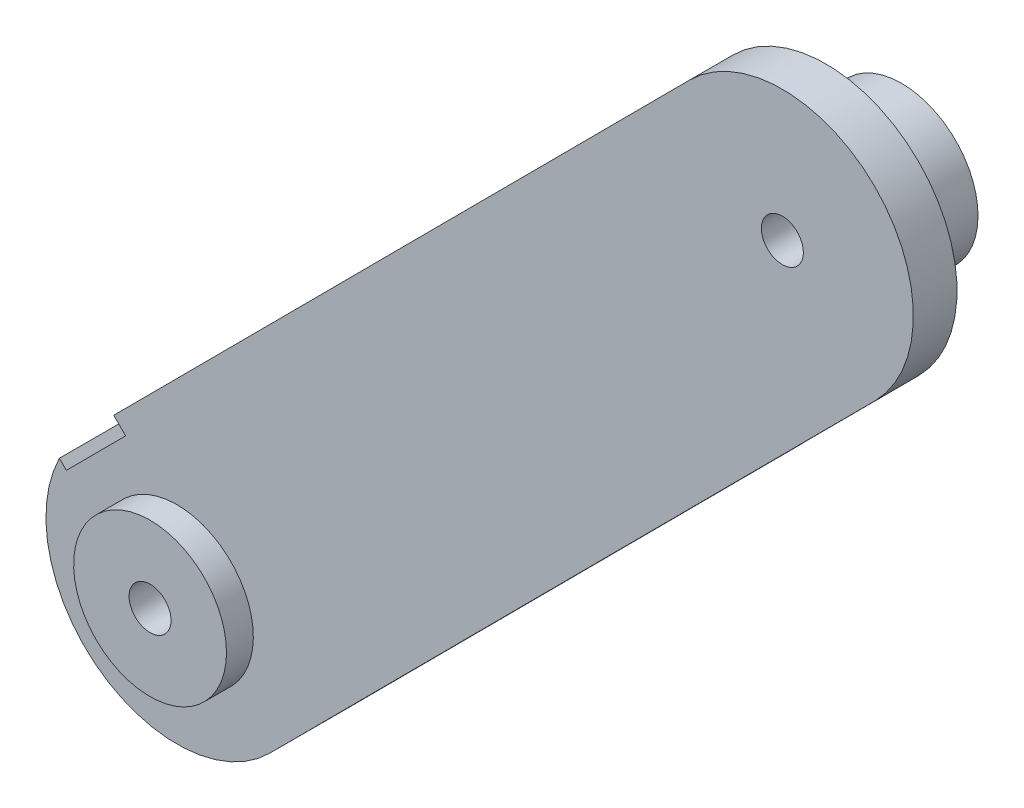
ISO-10303-21;
HEADER;
FILE_DESCRIPTION(('STEP AP214'),'2;1');
FILE_NAME('part.step','',(''),(''),'','','');
FILE_SCHEMA(('AUTOMOTIVE_DESIGN { 1 0 10303 214 1 1 1 1 }'));
ENDSEC;
DATA;
#1=APPLICATION_CONTEXT('core data for automotive mechanical design processes');
#2=APPLICATION_PROTOCOL_DEFINITION('international standard','automotive_design',2000,#1);
#3=PRODUCT_CONTEXT('',#1,'mechanical');
#4=PRODUCT('Part','Part','',(#3));
#5=PRODUCT_RELATED_PRODUCT_CATEGORY('part','',(#4));
#6=PRODUCT_DEFINITION_FORMATION('','',#4);
#7=PRODUCT_DEFINITION_CONTEXT('part definition',#1,'design');
#8=PRODUCT_DEFINITION('design','',#6,#7);
#9=PRODUCT_DEFINITION_SHAPE('','',#8);
#10=(LENGTH_UNIT() NAMED_UNIT(*) SI_UNIT(.MILLI.,.METRE.));
#11=(NAMED_UNIT(*) PLANE_ANGLE_UNIT() SI_UNIT($,.RADIAN.));
#12=(NAMED_UNIT(*) SI_UNIT($,.STERADIAN.) SOLID_ANGLE_UNIT());
#13=UNCERTAINTY_MEASURE_WITH_UNIT(LENGTH_MEASURE(1.E-05),#10,'distance_accuracy_value','');
#14=(GEOMETRIC_REPRESENTATION_CONTEXT(3) GLOBAL_UNCERTAINTY_ASSIGNED_CONTEXT((#13)) GLOBAL_UNIT_ASSIGNED_CONTEXT((#10,
#11,#12)) REPRESENTATION_CONTEXT('',''));
#15=CARTESIAN_POINT('',(0.,0.,0.));
#16=DIRECTION('',(0.,0.,1.));
#17=DIRECTION('',(1.,0.,0.));
#18=AXIS2_PLACEMENT_3D('',#15,#16,#17);
#19=CARTESIAN_POINT('',(88.4066610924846,19.98499077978,4.4196));
#20=DIRECTION('',(0.,0.,1.));
#21=DIRECTION('',(0.708586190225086,-0.705624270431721,0.));
#22=AXIS2_PLACEMENT_3D('',#19,#20,#21);
#23=PLANE('',#22);
#24=CARTESIAN_POINT('',(91.8389073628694,19.9921791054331,4.4196));
#25=DIRECTION('',(0.,0.,-1.));
#26=DIRECTION('',(-1.,0.,0.));
#27=AXIS2_PLACEMENT_3D('',#24,#25,#26);
#28=CIRCLE('',#27,0.634999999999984);
#29=CARTESIAN_POINT('',(91.3908359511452,19.5422268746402,4.4196));
#30=VERTEX_POINT('',#29);
#31=EDGE_CURVE('E10',#30,#30,#28,.T.);
#32=ORIENTED_EDGE('',*,*,#31,.T.);
#33=EDGE_LOOP('',(#32));
#34=FACE_BOUND('',#33,.T.);
#35=CARTESIAN_POINT('',(91.8389073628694,19.9921791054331,4.41960000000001));
#36=DIRECTION('',(0.,0.,-1.));
#37=DIRECTION('',(-1.,0.,0.));
#38=AXIS2_PLACEMENT_3D('',#35,#36,#37);
#39=CIRCLE('',#38,2.3114);
#40=CARTESIAN_POINT('',(90.2079274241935,18.3543529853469,4.4196));
#41=VERTEX_POINT('',#40);
#42=EDGE_CURVE('E25',#41,#41,#39,.T.);
#43=ORIENTED_EDGE('',*,*,#42,.F.);
#44=EDGE_LOOP('',(#43));
#45=FACE_BOUND('',#44,.T.);
#46=ADVANCED_FACE('F15',(#34,#45),#23,.T.);
#47=CARTESIAN_POINT('',(91.8389073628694,19.9921791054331,0.));
#48=DIRECTION('',(0.,0.,1.));
#49=DIRECTION('',(1.,0.,0.));
#50=AXIS2_PLACEMENT_3D('',#47,#48,#49);
#51=CYLINDRICAL_SURFACE('',#50,2.3114);
#52=CARTESIAN_POINT('',(91.8389073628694,19.9921791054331,3.6068));
#53=DIRECTION('',(0.,0.,-1.));
#54=DIRECTION('',(-1.,0.,0.));
#55=AXIS2_PLACEMENT_3D('',#52,#53,#54);
#56=CIRCLE('',#55,2.31140000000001);
#57=CARTESIAN_POINT('',(90.2079274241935,18.3543529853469,3.6068));
#58=VERTEX_POINT('',#57);
#59=EDGE_CURVE('E223',#58,#58,#56,.T.);
#60=ORIENTED_EDGE('',*,*,#59,.F.);
#61=DIRECTION('',(0.,0.,-1.));
#62=VECTOR('',#61,1.);
#63=CARTESIAN_POINT('',(90.2079274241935,18.3543529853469,4.0132));
#64=LINE('',#63,#62);
#65=EDGE_CURVE('E216',#41,#58,#64,.T.);
#66=ORIENTED_EDGE('',*,*,#65,.F.);
#67=ORIENTED_EDGE('',*,*,#42,.T.);
#68=ORIENTED_EDGE('',*,*,#65,.T.);
#69=EDGE_LOOP('',(#60,#66,#67,#68));
#70=FACE_BOUND('',#69,.T.);
#71=ADVANCED_FACE('F210',(#70),#51,.T.);
#72=CARTESIAN_POINT('',(110.597995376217,44.7262353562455,3.6068));
#73=DIRECTION('',(0.,0.,1.));
#74=DIRECTION('',(-0.705624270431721,-0.708586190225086,0.));
#75=AXIS2_PLACEMENT_3D('',#72,#73,#74);
#76=PLANE('',#75);
#77=CARTESIAN_POINT('',(110.152482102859,38.3826266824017,3.6068));
#78=DIRECTION('',(0.,0.,-1.));
#79=DIRECTION('',(-1.,0.,0.));
#80=AXIS2_PLACEMENT_3D('',#77,#78,#79);
#81=CIRCLE('',#80,0.634999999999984);
#82=CARTESIAN_POINT('',(109.704410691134,37.9326744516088,3.6068));
#83=VERTEX_POINT('',#82);
#84=EDGE_CURVE('E218',#83,#83,#81,.T.);
#85=ORIENTED_EDGE('',*,*,#84,.T.);
#86=EDGE_LOOP('',(#85));
#87=FACE_BOUND('',#86,.T.);
#88=ORIENTED_EDGE('',*,*,#59,.T.);
#89=EDGE_LOOP('',(#88));
#90=FACE_BOUND('',#89,.T.);
#91=DIRECTION('',(0.708586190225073,-0.705624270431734,0.));
#92=VECTOR('',#91,1.);
#93=CARTESIAN_POINT('',(90.1073291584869,23.508820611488,3.6068));
#94=LINE('',#93,#92);
#95=CARTESIAN_POINT('',(89.9273482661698,23.6880491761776,3.6068));
#96=VERTEX_POINT('',#95);
#97=CARTESIAN_POINT('',(90.2873100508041,23.3295920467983,3.6068));
#98=VERTEX_POINT('',#97);
#99=EDGE_CURVE('E226',#96,#98,#94,.T.);
#100=ORIENTED_EDGE('',*,*,#99,.T.);
#101=DIRECTION('',(-0.70562427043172,-0.708586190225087,0.));
#102=VECTOR('',#101,1.);
#103=CARTESIAN_POINT('',(89.3911672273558,22.4296875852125,3.6068));
#104=LINE('',#103,#102);
#105=CARTESIAN_POINT('',(88.4950244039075,21.5297831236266,3.6068));
#106=VERTEX_POINT('',#105);
#107=EDGE_CURVE('E229',#98,#106,#104,.T.);
#108=ORIENTED_EDGE('',*,*,#107,.T.);
#109=DIRECTION('',(-0.708586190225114,0.705624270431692,0.));
#110=VECTOR('',#109,1.);
#111=CARTESIAN_POINT('',(88.3891048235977,21.6352599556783,3.6068));
#112=LINE('',#111,#110);
#113=CARTESIAN_POINT('',(88.2831852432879,21.74073678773,3.6068));
#114=VERTEX_POINT('',#113);
#115=EDGE_CURVE('E232',#106,#114,#112,.T.);
#116=ORIENTED_EDGE('',*,*,#115,.T.);
#117=CARTESIAN_POINT('',(91.8389073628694,19.9921791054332,3.6068));
#118=DIRECTION('',(0.,0.,1.));
#119=DIRECTION('',(1.,0.,0.));
#120=AXIS2_PLACEMENT_3D('',#117,#118,#119);
#121=CIRCLE('',#120,3.96240000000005);
#122=CARTESIAN_POINT('',(94.6466092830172,17.1962134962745,3.6068));
#123=VERTEX_POINT('',#122);
#124=EDGE_CURVE('E235',#114,#123,#121,.T.);
#125=ORIENTED_EDGE('',*,*,#124,.T.);
#126=DIRECTION('',(-0.705624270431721,-0.708586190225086,0.));
#127=VECTOR('',#126,1.);
#128=CARTESIAN_POINT('',(103.803396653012,26.3914372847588,3.6068));
#129=LINE('',#128,#127);
#130=CARTESIAN_POINT('',(112.960184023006,35.5866610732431,3.6068));
#131=VERTEX_POINT('',#130);
#132=EDGE_CURVE('E276',#131,#123,#129,.T.);
#133=ORIENTED_EDGE('',*,*,#132,.F.);
#134=CARTESIAN_POINT('',(110.152482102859,38.3826266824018,3.6068));
#135=DIRECTION('',(0.,0.,1.));
#136=DIRECTION('',(1.,0.,0.));
#137=AXIS2_PLACEMENT_3D('',#134,#135,#136);
#138=CIRCLE('',#137,3.96239999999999);
#139=CARTESIAN_POINT('',(107.344780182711,41.1785922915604,3.6068));
#140=VERTEX_POINT('',#139);
#141=EDGE_CURVE('E238',#131,#140,#138,.T.);
#142=ORIENTED_EDGE('',*,*,#141,.T.);
#143=DIRECTION('',(-0.705624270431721,-0.708586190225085,0.));
#144=VECTOR('',#143,1.);
#145=CARTESIAN_POINT('',(98.6360642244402,32.433320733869,3.6068));
#146=LINE('',#145,#144);
#147=EDGE_CURVE('E241',#140,#96,#146,.T.);
#148=ORIENTED_EDGE('',*,*,#147,.T.);
#149=EDGE_LOOP('',(#100,#108,#116,#125,#133,#142,#148));
#150=FACE_BOUND('',#149,.T.);
#151=ADVANCED_FACE('F305',(#87,#90,#150),#76,.T.);
#152=CARTESIAN_POINT('',(90.2873100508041,23.3295920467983,1.3208));
#153=DIRECTION('',(-0.705624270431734,-0.708586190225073,0.));
#154=DIRECTION('',(0.,0.,1.));
#155=AXIS2_PLACEMENT_3D('',#152,#153,#154);
#156=PLANE('',#155);
#157=ORIENTED_EDGE('',*,*,#99,.F.);
#158=DIRECTION('',(0.,0.,1.));
#159=VECTOR('',#158,1.);
#160=CARTESIAN_POINT('',(89.9273482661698,23.6880491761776,2.4638));
#161=LINE('',#160,#159);
#162=CARTESIAN_POINT('',(89.9273482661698,23.6880491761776,1.3208));
#163=VERTEX_POINT('',#162);
#164=EDGE_CURVE('E247',#163,#96,#161,.T.);
#165=ORIENTED_EDGE('',*,*,#164,.F.);
#166=DIRECTION('',(-0.708586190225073,0.705624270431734,0.));
#167=VECTOR('',#166,1.);
#168=CARTESIAN_POINT('',(90.1073291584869,23.508820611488,1.3208));
#169=LINE('',#168,#167);
#170=CARTESIAN_POINT('',(90.2873100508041,23.3295920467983,1.3208));
#171=VERTEX_POINT('',#170);
#172=EDGE_CURVE('E145',#171,#163,#169,.T.);
#173=ORIENTED_EDGE('',*,*,#172,.F.);
#174=DIRECTION('',(0.,0.,1.));
#175=VECTOR('',#174,1.);
#176=CARTESIAN_POINT('',(90.2873100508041,23.3295920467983,2.4638));
#177=LINE('',#176,#175);
#178=EDGE_CURVE('E244',#171,#98,#177,.T.);
#179=ORIENTED_EDGE('',*,*,#178,.T.);
#180=EDGE_LOOP('',(#157,#165,#173,#179));
#181=FACE_BOUND('',#180,.T.);
#182=ADVANCED_FACE('F311',(#181),#156,.T.);
#183=CARTESIAN_POINT('',(89.0312054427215,22.7881447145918,3.6068));
#184=DIRECTION('',(-0.708586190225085,0.705624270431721,0.));
#185=DIRECTION('',(0.705624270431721,0.708586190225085,0.));
#186=AXIS2_PLACEMENT_3D('',#183,#184,#185);
#187=PLANE('',#186);
#188=ORIENTED_EDGE('',*,*,#164,.T.);
#189=ORIENTED_EDGE('',*,*,#147,.F.);
#190=DIRECTION('',(0.,0.,1.));
#191=VECTOR('',#190,1.);
#192=CARTESIAN_POINT('',(107.344780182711,41.1785922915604,2.9464));
#193=LINE('',#192,#191);
#194=CARTESIAN_POINT('',(107.344780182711,41.1785922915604,2.286));
#195=VERTEX_POINT('',#194);
#196=EDGE_CURVE('E260',#195,#140,#193,.T.);
#197=ORIENTED_EDGE('',*,*,#196,.F.);
#198=DIRECTION('',(-0.705624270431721,-0.708586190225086,0.));
#199=VECTOR('',#198,1.);
#200=CARTESIAN_POINT('',(105.373265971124,39.1988024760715,2.286));
#201=LINE('',#200,#199);
#202=CARTESIAN_POINT('',(103.401751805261,37.2190126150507,2.286));
#203=VERTEX_POINT('',#202);
#204=EDGE_CURVE('E249',#195,#203,#201,.T.);
#205=ORIENTED_EDGE('',*,*,#204,.T.);
#206=CARTESIAN_POINT('',(103.401751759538,37.2190126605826,1.52400000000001));
#207=DIRECTION('',(0.708586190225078,-0.705624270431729,0.));
#208=DIRECTION('',(0.705624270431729,0.708586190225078,0.));
#209=AXIS2_PLACEMENT_3D('',#206,#207,#208);
#210=CIRCLE('',#209,0.761999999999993);
#211=CARTESIAN_POINT('',(102.864066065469,36.6790699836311,1.524));
#212=VERTEX_POINT('',#211);
#213=EDGE_CURVE('E252',#203,#212,#210,.T.);
#214=ORIENTED_EDGE('',*,*,#213,.T.);
#215=DIRECTION('',(0.,0.,-1.));
#216=VECTOR('',#215,1.);
#217=CARTESIAN_POINT('',(102.864066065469,36.6790699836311,1.4224));
#218=LINE('',#217,#216);
#219=CARTESIAN_POINT('',(102.864066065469,36.6790699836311,1.3208));
#220=VERTEX_POINT('',#219);
#221=EDGE_CURVE('E255',#212,#220,#218,.T.);
#222=ORIENTED_EDGE('',*,*,#221,.T.);
#223=DIRECTION('',(0.705624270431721,0.708586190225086,0.));
#224=VECTOR('',#223,1.);
#225=CARTESIAN_POINT('',(96.3957071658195,30.1835595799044,1.3208));
#226=LINE('',#225,#224);
#227=EDGE_CURVE('E149',#163,#220,#226,.T.);
#228=ORIENTED_EDGE('',*,*,#227,.F.);
#229=EDGE_LOOP('',(#188,#189,#197,#205,#214,#222,#228));
#230=FACE_BOUND('',#229,.T.);
#231=ADVANCED_FACE('F315',(#230),#187,.T.);
#232=CARTESIAN_POINT('',(110.152482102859,38.3826266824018,3.6068));
#233=DIRECTION('',(0.,0.,-1.));
#234=DIRECTION('',(0.,1.,0.));
#235=AXIS2_PLACEMENT_3D('',#232,#233,#234);
#236=CYLINDRICAL_SURFACE('',#235,3.96239999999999);
#237=CARTESIAN_POINT('',(110.152482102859,38.3826266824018,2.286));
#238=DIRECTION('',(0.,0.,1.));
#239=DIRECTION('',(1.,0.,0.));
#240=AXIS2_PLACEMENT_3D('',#237,#238,#239);
#241=CIRCLE('',#240,3.96239999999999);
#242=CARTESIAN_POINT('',(112.960184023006,35.5866610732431,2.286));
#243=VERTEX_POINT('',#242);
#244=EDGE_CURVE('E258',#243,#195,#241,.T.);
#245=ORIENTED_EDGE('',*,*,#244,.T.);
#246=ORIENTED_EDGE('',*,*,#196,.T.);
#247=ORIENTED_EDGE('',*,*,#141,.F.);
#248=DIRECTION('',(0.,0.,1.));
#249=VECTOR('',#248,1.);
#250=CARTESIAN_POINT('',(112.960184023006,35.5866610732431,2.9464));
#251=LINE('',#250,#249);
#252=EDGE_CURVE('E274',#243,#131,#251,.T.);
#253=ORIENTED_EDGE('',*,*,#252,.F.);
#254=EDGE_LOOP('',(#245,#246,#247,#253));
#255=FACE_BOUND('',#254,.T.);
#256=ADVANCED_FACE('F329',(#255),#236,.T.);
#257=CARTESIAN_POINT('',(116.07845174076,38.4372457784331,2.286));
#258=DIRECTION('',(0.,0.,-1.));
#259=DIRECTION('',(-0.70562427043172,-0.708586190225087,0.));
#260=AXIS2_PLACEMENT_3D('',#257,#258,#259);
#261=PLANE('',#260);
#262=CARTESIAN_POINT('',(110.152482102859,38.3826266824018,2.286));
#263=DIRECTION('',(0.,0.,-1.));
#264=DIRECTION('',(-1.,0.,0.));
#265=AXIS2_PLACEMENT_3D('',#262,#263,#264);
#266=CIRCLE('',#265,3.07340000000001);
#267=CARTESIAN_POINT('',(112.321147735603,40.5603954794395,2.286));
#268=VERTEX_POINT('',#267);
#269=EDGE_CURVE('E179',#268,#268,#266,.T.);
#270=ORIENTED_EDGE('',*,*,#269,.F.);
#271=EDGE_LOOP('',(#270));
#272=FACE_BOUND('',#271,.T.);
#273=DIRECTION('',(0.708586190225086,-0.70562427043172,0.));
#274=VECTOR('',#273,1.);
#275=CARTESIAN_POINT('',(106.209453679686,34.423047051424,2.286));
#276=LINE('',#275,#274);
#277=CARTESIAN_POINT('',(109.017155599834,31.6270814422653,2.286));
#278=VERTEX_POINT('',#277);
#279=EDGE_CURVE('E265',#203,#278,#276,.T.);
#280=ORIENTED_EDGE('',*,*,#279,.F.);
#281=ORIENTED_EDGE('',*,*,#204,.F.);
#282=ORIENTED_EDGE('',*,*,#244,.F.);
#283=DIRECTION('',(0.70562427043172,0.708586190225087,0.));
#284=VECTOR('',#283,1.);
#285=CARTESIAN_POINT('',(110.98866981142,33.6068712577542,2.286));
#286=LINE('',#285,#284);
#287=EDGE_CURVE('E271',#278,#243,#286,.T.);
#288=ORIENTED_EDGE('',*,*,#287,.F.);
#289=EDGE_LOOP('',(#280,#281,#282,#288));
#290=FACE_BOUND('',#289,.T.);
#291=ADVANCED_FACE('F325',(#272,#290),#261,.T.);
#292=CARTESIAN_POINT('',(103.401751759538,37.2190126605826,1.52400000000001));
#293=DIRECTION('',(0.708586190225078,-0.705624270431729,0.));
#294=DIRECTION('',(0.705624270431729,0.708586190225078,0.));
#295=AXIS2_PLACEMENT_3D('',#292,#293,#294);
#296=CYLINDRICAL_SURFACE('',#295,0.761999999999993);
#297=DIRECTION('',(-0.708586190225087,0.70562427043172,0.));
#298=VECTOR('',#297,1.);
#299=CARTESIAN_POINT('',(105.671767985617,33.8831043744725,1.524));
#300=LINE('',#299,#298);
#301=CARTESIAN_POINT('',(108.479469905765,31.0871387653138,1.524));
#302=VERTEX_POINT('',#301);
#303=EDGE_CURVE('E263',#302,#212,#300,.T.);
#304=ORIENTED_EDGE('',*,*,#303,.T.);
#305=ORIENTED_EDGE('',*,*,#213,.F.);
#306=ORIENTED_EDGE('',*,*,#279,.T.);
#307=CARTESIAN_POINT('',(109.017155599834,31.6270814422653,1.524));
#308=DIRECTION('',(-0.70858619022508,0.705624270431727,0.));
#309=DIRECTION('',(-0.705624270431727,-0.70858619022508,0.));
#310=AXIS2_PLACEMENT_3D('',#307,#308,#309);
#311=CIRCLE('',#310,0.761999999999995);
#312=EDGE_CURVE('E268',#302,#278,#311,.T.);
#313=ORIENTED_EDGE('',*,*,#312,.F.);
#314=EDGE_LOOP('',(#304,#305,#306,#313));
#315=FACE_BOUND('',#314,.T.);
#316=ADVANCED_FACE('F322',(#315),#296,.F.);
#317=CARTESIAN_POINT('',(102.864066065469,36.6790699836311,1.3208));
#318=DIRECTION('',(0.70562427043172,0.708586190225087,0.));
#319=DIRECTION('',(0.,0.,1.));
#320=AXIS2_PLACEMENT_3D('',#317,#318,#319);
#321=PLANE('',#320);
#322=ORIENTED_EDGE('',*,*,#303,.F.);
#323=DIRECTION('',(0.,0.,1.));
#324=VECTOR('',#323,1.);
#325=CARTESIAN_POINT('',(108.479469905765,31.0871387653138,1.4224));
#326=LINE('',#325,#324);
#327=CARTESIAN_POINT('',(108.479469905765,31.0871387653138,1.3208));
#328=VERTEX_POINT('',#327);
#329=EDGE_CURVE('E285',#328,#302,#326,.T.);
#330=ORIENTED_EDGE('',*,*,#329,.F.);
#331=DIRECTION('',(0.708586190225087,-0.70562427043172,0.));
#332=VECTOR('',#331,1.);
#333=CARTESIAN_POINT('',(105.671767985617,33.8831043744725,1.3208));
#334=LINE('',#333,#332);
#335=EDGE_CURVE('E155',#220,#328,#334,.T.);
#336=ORIENTED_EDGE('',*,*,#335,.F.);
#337=ORIENTED_EDGE('',*,*,#221,.F.);
#338=EDGE_LOOP('',(#322,#330,#336,#337));
#339=FACE_BOUND('',#338,.T.);
#340=ADVANCED_FACE('F319',(#339),#321,.T.);
#341=CARTESIAN_POINT('',(112.960184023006,35.5866610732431,3.6068));
#342=DIRECTION('',(0.708586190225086,-0.705624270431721,0.));
#343=DIRECTION('',(-0.705624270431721,-0.708586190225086,0.));
#344=AXIS2_PLACEMENT_3D('',#341,#342,#343);
#345=PLANE('',#344);
#346=ORIENTED_EDGE('',*,*,#312,.T.);
#347=ORIENTED_EDGE('',*,*,#287,.T.);
#348=ORIENTED_EDGE('',*,*,#252,.T.);
#349=ORIENTED_EDGE('',*,*,#132,.T.);
#350=DIRECTION('',(0.,0.,-1.));
#351=VECTOR('',#350,1.);
#352=CARTESIAN_POINT('',(94.6466092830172,17.1962134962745,2.4638));
#353=LINE('',#352,#351);
#354=CARTESIAN_POINT('',(94.6466092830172,17.1962134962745,1.3208));
#355=VERTEX_POINT('',#354);
#356=EDGE_CURVE('E279',#123,#355,#353,.T.);
#357=ORIENTED_EDGE('',*,*,#356,.T.);
#358=DIRECTION('',(0.705624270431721,0.708586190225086,0.));
#359=VECTOR('',#358,1.);
#360=CARTESIAN_POINT('',(101.563039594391,24.1416761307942,1.3208));
#361=LINE('',#360,#359);
#362=EDGE_CURVE('E282',#355,#328,#361,.T.);
#363=ORIENTED_EDGE('',*,*,#362,.T.);
#364=ORIENTED_EDGE('',*,*,#329,.T.);
#365=EDGE_LOOP('',(#346,#347,#348,#349,#357,#363,#364));
#366=FACE_BOUND('',#365,.T.);
#367=ADVANCED_FACE('F302',(#366),#345,.T.);
#368=CARTESIAN_POINT('',(91.8389073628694,19.9921791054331,3.6068));
#369=DIRECTION('',(0.,0.,-1.));
#370=DIRECTION('',(0.,1.,0.));
#371=AXIS2_PLACEMENT_3D('',#368,#369,#370);
#372=CYLINDRICAL_SURFACE('',#371,3.9624);
#373=DIRECTION('',(0.,0.,-1.));
#374=VECTOR('',#373,1.);
#375=CARTESIAN_POINT('',(88.2831852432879,21.74073678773,2.4638));
#376=LINE('',#375,#374);
#377=CARTESIAN_POINT('',(88.2831852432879,21.74073678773,1.3208));
#378=VERTEX_POINT('',#377);
#379=EDGE_CURVE('E147',#114,#378,#376,.T.);
#380=ORIENTED_EDGE('',*,*,#379,.T.);
#381=CARTESIAN_POINT('',(91.8389073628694,19.9921791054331,1.3208));
#382=DIRECTION('',(0.,0.,-1.));
#383=DIRECTION('',(-1.,0.,0.));
#384=AXIS2_PLACEMENT_3D('',#381,#382,#383);
#385=CIRCLE('',#384,3.9624);
#386=EDGE_CURVE('E157',#355,#378,#385,.T.);
#387=ORIENTED_EDGE('',*,*,#386,.F.);
#388=ORIENTED_EDGE('',*,*,#356,.F.);
#389=ORIENTED_EDGE('',*,*,#124,.F.);
#390=EDGE_LOOP('',(#380,#387,#388,#389));
#391=FACE_BOUND('',#390,.T.);
#392=ADVANCED_FACE('F291',(#391),#372,.T.);
#393=CARTESIAN_POINT('',(88.2831852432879,21.74073678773,1.3208));
#394=DIRECTION('',(0.705624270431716,0.708586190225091,0.));
#395=DIRECTION('',(0.,0.,1.));
#396=AXIS2_PLACEMENT_3D('',#393,#394,#395);
#397=PLANE('',#396);
#398=ORIENTED_EDGE('',*,*,#115,.F.);
#399=DIRECTION('',(0.,0.,1.));
#400=VECTOR('',#399,1.);
#401=CARTESIAN_POINT('',(88.4950244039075,21.5297831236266,2.4638));
#402=LINE('',#401,#400);
#403=CARTESIAN_POINT('',(88.4950244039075,21.5297831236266,1.3208));
#404=VERTEX_POINT('',#403);
#405=EDGE_CURVE('E144',#404,#106,#402,.T.);
#406=ORIENTED_EDGE('',*,*,#405,.F.);
#407=DIRECTION('',(0.708586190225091,-0.705624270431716,0.));
#408=VECTOR('',#407,1.);
#409=CARTESIAN_POINT('',(88.3891048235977,21.6352599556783,1.3208));
#410=LINE('',#409,#408);
#411=EDGE_CURVE('E159',#378,#404,#410,.T.);
#412=ORIENTED_EDGE('',*,*,#411,.F.);
#413=ORIENTED_EDGE('',*,*,#379,.F.);
#414=EDGE_LOOP('',(#398,#406,#412,#413));
#415=FACE_BOUND('',#414,.T.);
#416=ADVANCED_FACE('F296',(#415),#397,.T.);
#417=CARTESIAN_POINT('',(88.4950244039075,21.5297831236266,1.3208));
#418=DIRECTION('',(-0.708586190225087,0.70562427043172,0.));
#419=DIRECTION('',(0.,0.,1.));
#420=AXIS2_PLACEMENT_3D('',#417,#418,#419);
#421=PLANE('',#420);
#422=ORIENTED_EDGE('',*,*,#107,.F.);
#423=ORIENTED_EDGE('',*,*,#178,.F.);
#424=DIRECTION('',(0.70562427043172,0.708586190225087,0.));
#425=VECTOR('',#424,1.);
#426=CARTESIAN_POINT('',(89.3911672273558,22.4296875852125,1.3208));
#427=LINE('',#426,#425);
#428=EDGE_CURVE('E162',#404,#171,#427,.T.);
#429=ORIENTED_EDGE('',*,*,#428,.F.);
#430=ORIENTED_EDGE('',*,*,#405,.T.);
#431=EDGE_LOOP('',(#422,#423,#429,#430));
#432=FACE_BOUND('',#431,.T.);
#433=ADVANCED_FACE('F309',(#432),#421,.T.);
#434=CARTESIAN_POINT('',(91.3933910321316,13.6485673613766,1.3208));
#435=DIRECTION('',(0.,0.,-1.));
#436=DIRECTION('',(-0.708586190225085,0.705624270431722,0.));
#437=AXIS2_PLACEMENT_3D('',#434,#435,#436);
#438=PLANE('',#437);
#439=CARTESIAN_POINT('',(91.8389073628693,19.9921791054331,1.3208));
#440=DIRECTION('',(0.,0.,1.));
#441=DIRECTION('',(0.,-1.,0.));
#442=AXIS2_PLACEMENT_3D('',#439,#440,#441);
#443=CIRCLE('',#442,3.07340000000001);
#444=CARTESIAN_POINT('',(94.0075729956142,22.1699479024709,1.3208));
#445=VERTEX_POINT('',#444);
#446=EDGE_CURVE('E139',#445,#445,#443,.T.);
#447=ORIENTED_EDGE('',*,*,#446,.T.);
#448=EDGE_LOOP('',(#447));
#449=FACE_BOUND('',#448,.T.);
#450=ORIENTED_EDGE('',*,*,#172,.T.);
#451=ORIENTED_EDGE('',*,*,#227,.T.);
#452=ORIENTED_EDGE('',*,*,#335,.T.);
#453=ORIENTED_EDGE('',*,*,#362,.F.);
#454=ORIENTED_EDGE('',*,*,#386,.T.);
#455=ORIENTED_EDGE('',*,*,#411,.T.);
#456=ORIENTED_EDGE('',*,*,#428,.T.);
#457=EDGE_LOOP('',(#450,#451,#452,#453,#454,#455,#456));
#458=FACE_BOUND('',#457,.T.);
#459=ADVANCED_FACE('F298',(#449,#458),#438,.T.);
#460=CARTESIAN_POINT('',(91.8389073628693,19.9921791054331,1.32080000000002));
#461=DIRECTION('',(0.,0.,1.));
#462=DIRECTION('',(0.,-1.,0.));
#463=AXIS2_PLACEMENT_3D('',#460,#461,#462);
#464=TOROIDAL_SURFACE('',#463,2.69240000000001,0.381000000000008);
#465=CARTESIAN_POINT('',(93.7387301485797,21.8999765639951,1.32080000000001));
#466=DIRECTION('',(-0.708586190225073,0.705624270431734,0.));
#467=DIRECTION('',(-0.705624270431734,-0.708586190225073,0.));
#468=AXIS2_PLACEMENT_3D('',#465,#466,#467);
#469=CIRCLE('',#468,0.381000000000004);
#470=CARTESIAN_POINT('',(93.4698873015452,21.6300052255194,1.3208));
#471=VERTEX_POINT('',#470);
#472=EDGE_CURVE('E142',#471,#445,#469,.T.);
#473=ORIENTED_EDGE('',*,*,#472,.F.);
#474=CARTESIAN_POINT('',(91.8389073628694,19.9921791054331,1.3208));
#475=DIRECTION('',(0.,0.,-1.));
#476=DIRECTION('',(-1.,0.,0.));
#477=AXIS2_PLACEMENT_3D('',#474,#475,#476);
#478=CIRCLE('',#477,2.3114);
#479=CARTESIAN_POINT('',(90.2079274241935,18.3543529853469,1.3208));
#480=VERTEX_POINT('',#479);
#481=EDGE_CURVE('E165',#480,#471,#478,.T.);
#482=ORIENTED_EDGE('',*,*,#481,.F.);
#483=CARTESIAN_POINT('',(91.8389073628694,19.9921791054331,1.3208));
#484=DIRECTION('',(0.,0.,-1.));
#485=DIRECTION('',(0.,1.,0.));
#486=AXIS2_PLACEMENT_3D('',#483,#484,#485);
#487=CIRCLE('',#486,2.31139999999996);
#488=EDGE_CURVE('E168',#471,#480,#487,.T.);
#489=ORIENTED_EDGE('',*,*,#488,.F.);
#490=ORIENTED_EDGE('',*,*,#472,.T.);
#491=ORIENTED_EDGE('',*,*,#446,.F.);
#492=EDGE_LOOP('',(#473,#482,#489,#490,#491));
#493=FACE_BOUND('',#492,.T.);
#494=ADVANCED_FACE('F140',(#493),#464,.F.);
#495=CARTESIAN_POINT('',(91.8389073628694,19.9921791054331,0.));
#496=DIRECTION('',(0.,0.,1.));
#497=DIRECTION('',(1.,0.,0.));
#498=AXIS2_PLACEMENT_3D('',#495,#496,#497);
#499=CYLINDRICAL_SURFACE('',#498,2.3114);
#500=ORIENTED_EDGE('',*,*,#481,.T.);
#501=ORIENTED_EDGE('',*,*,#488,.T.);
#502=DIRECTION('',(0.,0.,-1.));
#503=VECTOR('',#502,1.);
#504=CARTESIAN_POINT('',(90.2079274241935,18.3543529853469,0.6604));
#505=LINE('',#504,#503);
#506=CARTESIAN_POINT('',(90.2079274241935,18.3543529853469,0.));
#507=VERTEX_POINT('',#506);
#508=EDGE_CURVE('E170',#480,#507,#505,.T.);
#509=ORIENTED_EDGE('',*,*,#508,.T.);
#510=CARTESIAN_POINT('',(91.8389073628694,19.9921791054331,0.));
#511=DIRECTION('',(0.,0.,1.));
#512=DIRECTION('',(1.,0.,0.));
#513=AXIS2_PLACEMENT_3D('',#510,#511,#512);
#514=CIRCLE('',#513,2.31139999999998);
#515=EDGE_CURVE('E173',#507,#507,#514,.T.);
#516=ORIENTED_EDGE('',*,*,#515,.T.);
#517=ORIENTED_EDGE('',*,*,#508,.F.);
#518=EDGE_LOOP('',(#500,#501,#509,#516,#517));
#519=FACE_BOUND('',#518,.T.);
#520=ADVANCED_FACE('F359',(#519),#499,.T.);
#521=CARTESIAN_POINT('',(95.2711536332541,19.9993674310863,0.));
#522=DIRECTION('',(0.,0.,-1.));
#523=DIRECTION('',(-0.705624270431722,-0.708586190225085,0.));
#524=AXIS2_PLACEMENT_3D('',#521,#522,#523);
#525=PLANE('',#524);
#526=ORIENTED_EDGE('',*,*,#515,.F.);
#527=EDGE_LOOP('',(#526));
#528=FACE_BOUND('',#527,.T.);
#529=ADVANCED_FACE('F362',(#528),#525,.T.);
#530=CARTESIAN_POINT('',(110.152482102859,38.3826266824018,2.286));
#531=DIRECTION('',(0.,0.,1.));
#532=DIRECTION('',(0.,-1.,0.));
#533=AXIS2_PLACEMENT_3D('',#530,#531,#532);
#534=TOROIDAL_SURFACE('',#533,2.69239999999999,0.381000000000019);
#535=CARTESIAN_POINT('',(112.052304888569,40.2904241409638,2.28599999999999));
#536=DIRECTION('',(-0.708586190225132,0.705624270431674,0.));
#537=DIRECTION('',(-0.705624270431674,-0.708586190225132,0.));
#538=AXIS2_PLACEMENT_3D('',#535,#536,#537);
#539=CIRCLE('',#538,0.381000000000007);
#540=CARTESIAN_POINT('',(111.783462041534,40.020452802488,2.286));
#541=VERTEX_POINT('',#540);
#542=EDGE_CURVE('E176',#541,#268,#539,.T.);
#543=ORIENTED_EDGE('',*,*,#542,.F.);
#544=CARTESIAN_POINT('',(110.152482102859,38.3826266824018,2.286));
#545=DIRECTION('',(0.,0.,-1.));
#546=DIRECTION('',(-1.,0.,0.));
#547=AXIS2_PLACEMENT_3D('',#544,#545,#546);
#548=CIRCLE('',#547,2.31139999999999);
#549=CARTESIAN_POINT('',(108.521502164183,36.7448005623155,2.286));
#550=VERTEX_POINT('',#549);
#551=EDGE_CURVE('E182',#550,#541,#548,.T.);
#552=ORIENTED_EDGE('',*,*,#551,.F.);
#553=CARTESIAN_POINT('',(110.152482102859,38.3826266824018,2.286));
#554=DIRECTION('',(0.,0.,-1.));
#555=DIRECTION('',(0.,1.,0.));
#556=AXIS2_PLACEMENT_3D('',#553,#554,#555);
#557=CIRCLE('',#556,2.31140000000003);
#558=EDGE_CURVE('E185',#541,#550,#557,.T.);
#559=ORIENTED_EDGE('',*,*,#558,.F.);
#560=ORIENTED_EDGE('',*,*,#542,.T.);
#561=ORIENTED_EDGE('',*,*,#269,.T.);
#562=EDGE_LOOP('',(#543,#552,#559,#560,#561));
#563=FACE_BOUND('',#562,.T.);
#564=ADVANCED_FACE('F366',(#563),#534,.F.);
#565=CARTESIAN_POINT('',(110.152482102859,38.3826266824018,3.6068));
#566=DIRECTION('',(0.,0.,-1.));
#567=DIRECTION('',(-1.,0.,0.));
#568=AXIS2_PLACEMENT_3D('',#565,#566,#567);
#569=CYLINDRICAL_SURFACE('',#568,2.31139999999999);
#570=ORIENTED_EDGE('',*,*,#551,.T.);
#571=ORIENTED_EDGE('',*,*,#558,.T.);
#572=DIRECTION('',(0.,0.,-1.));
#573=VECTOR('',#572,1.);
#574=CARTESIAN_POINT('',(108.521502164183,36.7448005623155,1.143));
#575=LINE('',#574,#573);
#576=CARTESIAN_POINT('',(108.521502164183,36.7448005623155,0.));
#577=VERTEX_POINT('',#576);
#578=EDGE_CURVE('E188',#550,#577,#575,.T.);
#579=ORIENTED_EDGE('',*,*,#578,.T.);
#580=CARTESIAN_POINT('',(110.152482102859,38.3826266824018,0.));
#581=DIRECTION('',(0.,0.,1.));
#582=DIRECTION('',(1.,0.,0.));
#583=AXIS2_PLACEMENT_3D('',#580,#581,#582);
#584=CIRCLE('',#583,2.31139999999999);
#585=EDGE_CURVE('E191',#577,#577,#584,.T.);
#586=ORIENTED_EDGE('',*,*,#585,.T.);
#587=ORIENTED_EDGE('',*,*,#578,.F.);
#588=EDGE_LOOP('',(#570,#571,#579,#586,#587));
#589=FACE_BOUND('',#588,.T.);
#590=ADVANCED_FACE('F370',(#589),#569,.T.);
#591=CARTESIAN_POINT('',(113.584728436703,38.3898154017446,0.));
#592=DIRECTION('',(0.,0.,-1.));
#593=DIRECTION('',(-0.705624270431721,-0.708586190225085,0.));
#594=AXIS2_PLACEMENT_3D('',#591,#592,#593);
#595=PLANE('',#594);
#596=ORIENTED_EDGE('',*,*,#585,.F.);
#597=EDGE_LOOP('',(#596));
#598=FACE_BOUND('',#597,.T.);
#599=ADVANCED_FACE('F374',(#598),#595,.T.);
#600=CARTESIAN_POINT('',(110.152482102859,38.3826266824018,3.6068));
#601=DIRECTION('',(0.,0.,-1.));
#602=DIRECTION('',(-1.,0.,0.));
#603=AXIS2_PLACEMENT_3D('',#600,#601,#602);
#604=CYLINDRICAL_SURFACE('',#603,0.634999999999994);
#605=DIRECTION('',(0.,0.,1.));
#606=VECTOR('',#605,1.);
#607=CARTESIAN_POINT('',(109.704410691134,37.9326744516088,2.9083));
#608=LINE('',#607,#606);
#609=CARTESIAN_POINT('',(109.704410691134,37.9326744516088,2.2098));
#610=VERTEX_POINT('',#609);
#611=EDGE_CURVE('E194',#610,#83,#608,.T.);
#612=ORIENTED_EDGE('',*,*,#611,.F.);
#613=CARTESIAN_POINT('',(110.152482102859,38.3826266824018,2.2098));
#614=DIRECTION('',(0.,0.,1.));
#615=DIRECTION('',(1.,0.,0.));
#616=AXIS2_PLACEMENT_3D('',#613,#614,#615);
#617=CIRCLE('',#616,0.63499999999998);
#618=EDGE_CURVE('E199',#610,#610,#617,.T.);
#619=ORIENTED_EDGE('',*,*,#618,.F.);
#620=ORIENTED_EDGE('',*,*,#611,.T.);
#621=ORIENTED_EDGE('',*,*,#84,.F.);
#622=EDGE_LOOP('',(#612,#619,#620,#621));
#623=FACE_BOUND('',#622,.T.);
#624=ADVANCED_FACE('F378',(#623),#604,.F.);
#625=CARTESIAN_POINT('',(110.152482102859,38.3826266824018,2.20980000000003));
#626=DIRECTION('',(0.,0.,-1.));
#627=DIRECTION('',(-0.705624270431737,-0.70858619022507,0.));
#628=AXIS2_PLACEMENT_3D('',#625,#626,#627);
#629=SPHERICAL_SURFACE('',#628,0.635000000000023);
#630=CARTESIAN_POINT('',(110.152482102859,38.3826266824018,2.2098));
#631=DIRECTION('',(-0.708586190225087,0.70562427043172,0.));
#632=DIRECTION('',(-0.70562427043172,-0.708586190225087,0.));
#633=AXIS2_PLACEMENT_3D('',#630,#631,#632);
#634=CIRCLE('',#633,0.635000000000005);
#635=CARTESIAN_POINT('',(110.152482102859,38.3826266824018,1.57480000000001));
#636=VERTEX_POINT('',#635);
#637=EDGE_CURVE('E196',#636,#610,#634,.T.);
#638=ORIENTED_EDGE('',*,*,#637,.F.);
#639=ORIENTED_EDGE('',*,*,#637,.T.);
#640=ORIENTED_EDGE('',*,*,#618,.T.);
#641=EDGE_LOOP('',(#638,#639,#640));
#642=FACE_BOUND('',#641,.T.);
#643=ADVANCED_FACE('F382',(#642),#629,.F.);
#644=CARTESIAN_POINT('',(91.8389073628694,19.9921791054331,4.4196));
#645=DIRECTION('',(0.,0.,-1.));
#646=DIRECTION('',(-1.,0.,0.));
#647=AXIS2_PLACEMENT_3D('',#644,#645,#646);
#648=CYLINDRICAL_SURFACE('',#647,0.634999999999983);
#649=DIRECTION('',(0.,0.,1.));
#650=VECTOR('',#649,1.);
#651=CARTESIAN_POINT('',(91.3908359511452,19.5422268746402,3.3401));
#652=LINE('',#651,#650);
#653=CARTESIAN_POINT('',(91.3908359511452,19.5422268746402,2.2606));
#654=VERTEX_POINT('',#653);
#655=EDGE_CURVE('E33',#654,#30,#652,.T.);
#656=ORIENTED_EDGE('',*,*,#655,.F.);
#657=CARTESIAN_POINT('',(91.8389073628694,19.9921791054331,2.2606));
#658=DIRECTION('',(0.,0.,1.));
#659=DIRECTION('',(0.,-1.,0.));
#660=AXIS2_PLACEMENT_3D('',#657,#658,#659);
#661=CIRCLE('',#660,0.63499999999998);
#662=EDGE_CURVE('E19',#654,#654,#661,.T.);
#663=ORIENTED_EDGE('',*,*,#662,.F.);
#664=ORIENTED_EDGE('',*,*,#655,.T.);
#665=ORIENTED_EDGE('',*,*,#31,.F.);
#666=EDGE_LOOP('',(#656,#663,#664,#665));
#667=FACE_BOUND('',#666,.T.);
#668=ADVANCED_FACE('F206',(#667),#648,.F.);
#669=CARTESIAN_POINT('',(91.8389073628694,19.9921791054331,2.26059999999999));
#670=DIRECTION('',(0.,0.,-1.));
#671=DIRECTION('',(-0.705624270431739,-0.708586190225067,0.));
#672=AXIS2_PLACEMENT_3D('',#669,#670,#671);
#673=SPHERICAL_SURFACE('',#672,0.634999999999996);
#674=CARTESIAN_POINT('',(91.8389073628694,19.9921791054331,2.26059999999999));
#675=DIRECTION('',(-0.708586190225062,0.705624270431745,0.));
#676=DIRECTION('',(-0.705624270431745,-0.708586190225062,0.));
#677=AXIS2_PLACEMENT_3D('',#674,#675,#676);
#678=CIRCLE('',#677,0.634999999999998);
#679=CARTESIAN_POINT('',(91.8389073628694,19.9921791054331,1.6256));
#680=VERTEX_POINT('',#679);
#681=EDGE_CURVE('E202',#680,#654,#678,.T.);
#682=ORIENTED_EDGE('',*,*,#681,.F.);
#683=ORIENTED_EDGE('',*,*,#681,.T.);
#684=ORIENTED_EDGE('',*,*,#662,.T.);
#685=EDGE_LOOP('',(#682,#683,#684));
#686=FACE_BOUND('',#685,.T.);
#687=ADVANCED_FACE('F17',(#686),#673,.F.);
#688=CLOSED_SHELL('',(#46,#71,#151,#182,#231,#256,#291,#316,#340,#367,#392,#416,#433,#459,#494,
#520,#529,#564,#590,#599,#624,#643,#668,#687));
#689=MANIFOLD_SOLID_BREP('B1',#688);
#690=ADVANCED_BREP_SHAPE_REPRESENTATION('',(#18,#689),#14);
#691=SHAPE_DEFINITION_REPRESENTATION(#9,#690);
ENDSEC;
END-ISO-10303-21;
